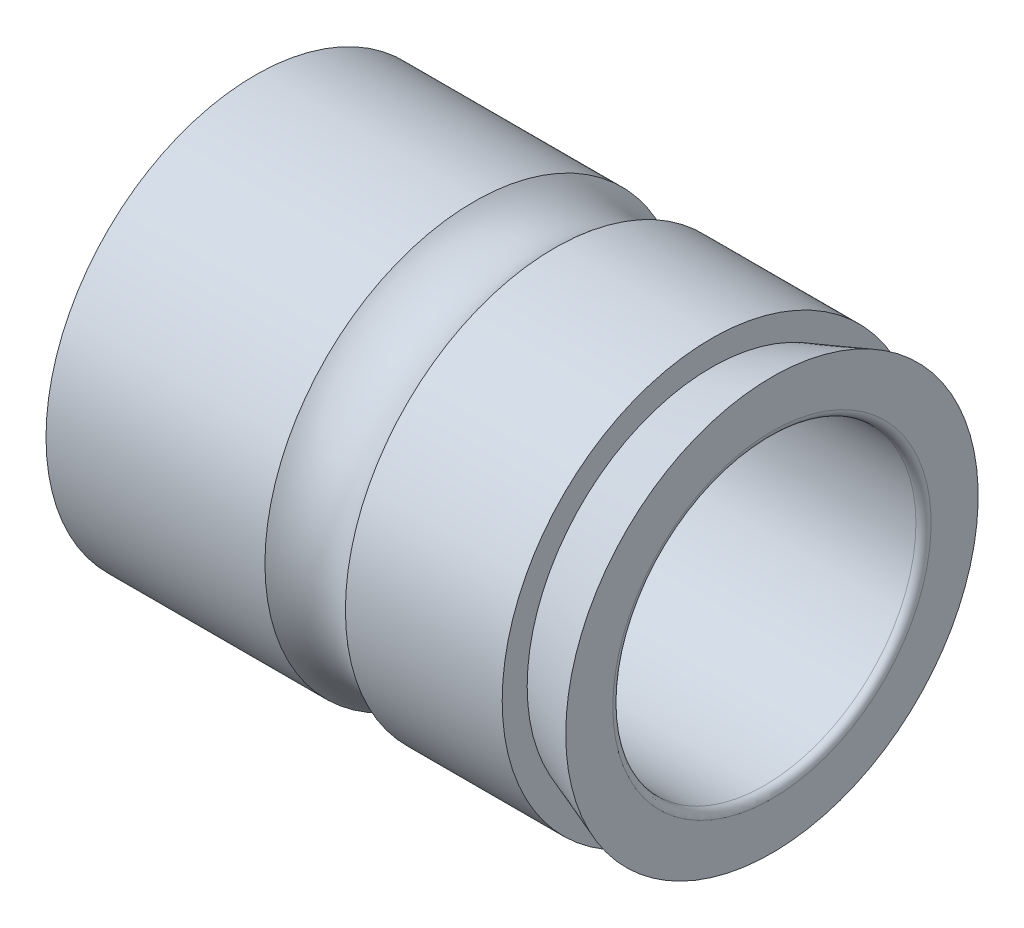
from build123d import *


with BuildPart() as part:
    # Esquisse1 → R_volution1 (revolve)
    with BuildSketch(Plane.XY, mode=Mode.PRIVATE) as r_volution1_sk:
        with BuildLine():
            Line((-17.1, 66.3), (-17.1, 63))
            ThreePointArc((-17.1, 63), (-16.953553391, 62.646446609), (-16.6, 62.5))
            Line((-16.6, 62.5), (16.5, 62.5))
            ThreePointArc((16.5, 62.5), (16.853553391, 62.646446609), (17, 63))
            Line((17, 63), (17, 66.105880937))
            Line((17, 66.105880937), (13, 64.65))
            Line((13, 64.65), (13, 66.3))
            Line((13, 66.3), (2.655270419, 66.3))
            ThreePointArc((2.655270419, 66.3), (0, 65.281), (-2.655270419, 66.3))
            Line((-2.655270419, 66.3), (-17.1, 66.3))
        make_face()
    revolve(r_volution1_sk.sketch.rotate(Axis((-23.24703204, 52.5, 0), (1, 0, 0)), 90), axis=Axis((-23.24703204, 52.5, 0), (1, 0, 0)))


solid = part.part
